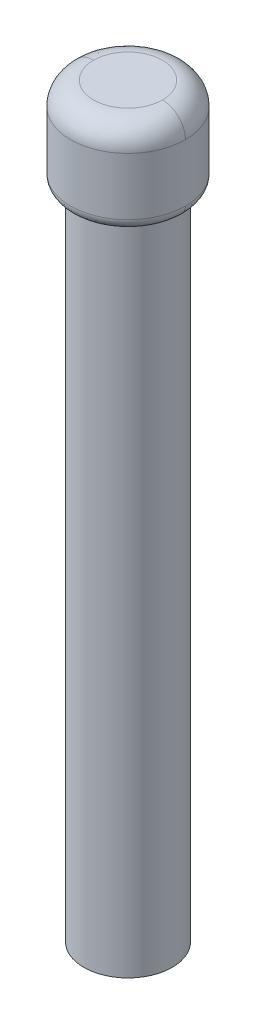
ISO-10303-21;
HEADER;
FILE_DESCRIPTION(('STEP AP214'),'2;1');
FILE_NAME('part.step','',(''),(''),'','','');
FILE_SCHEMA(('AUTOMOTIVE_DESIGN { 1 0 10303 214 1 1 1 1 }'));
ENDSEC;
DATA;
#1=APPLICATION_CONTEXT('core data for automotive mechanical design processes');
#2=APPLICATION_PROTOCOL_DEFINITION('international standard','automotive_design',2000,#1);
#3=PRODUCT_CONTEXT('',#1,'mechanical');
#4=PRODUCT('Part','Part','',(#3));
#5=PRODUCT_RELATED_PRODUCT_CATEGORY('part','',(#4));
#6=PRODUCT_DEFINITION_FORMATION('','',#4);
#7=PRODUCT_DEFINITION_CONTEXT('part definition',#1,'design');
#8=PRODUCT_DEFINITION('design','',#6,#7);
#9=PRODUCT_DEFINITION_SHAPE('','',#8);
#10=(LENGTH_UNIT() NAMED_UNIT(*) SI_UNIT(.MILLI.,.METRE.));
#11=(NAMED_UNIT(*) PLANE_ANGLE_UNIT() SI_UNIT($,.RADIAN.));
#12=(NAMED_UNIT(*) SI_UNIT($,.STERADIAN.) SOLID_ANGLE_UNIT());
#13=UNCERTAINTY_MEASURE_WITH_UNIT(LENGTH_MEASURE(1.E-05),#10,'distance_accuracy_value','');
#14=(GEOMETRIC_REPRESENTATION_CONTEXT(3) GLOBAL_UNCERTAINTY_ASSIGNED_CONTEXT((#13)) GLOBAL_UNIT_ASSIGNED_CONTEXT((#10,
#11,#12)) REPRESENTATION_CONTEXT('',''));
#15=CARTESIAN_POINT('',(0.,0.,0.));
#16=DIRECTION('',(0.,0.,1.));
#17=DIRECTION('',(1.,0.,0.));
#18=AXIS2_PLACEMENT_3D('',#15,#16,#17);
#19=CARTESIAN_POINT('',(0.312,-1.2,57.38699998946));
#20=DIRECTION('',(0.,-1.,0.));
#21=DIRECTION('',(-1.,0.,0.));
#22=AXIS2_PLACEMENT_3D('',#19,#20,#21);
#23=PLANE('',#22);
#24=CARTESIAN_POINT('',(0.,-1.20000000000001,57.075));
#25=DIRECTION('',(0.,-1.,0.));
#26=DIRECTION('',(1.,0.,0.));
#27=AXIS2_PLACEMENT_3D('',#24,#25,#26);
#28=CIRCLE('',#27,0.2999999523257);
#29=CARTESIAN_POINT('',(-0.299999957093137,-1.20000000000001,57.0749999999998));
#30=VERTEX_POINT('',#29);
#31=CARTESIAN_POINT('',(0.299999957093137,-1.20000000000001,57.0750000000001));
#32=VERTEX_POINT('',#31);
#33=EDGE_CURVE('E58',#30,#32,#28,.F.);
#34=ORIENTED_EDGE('',*,*,#33,.T.);
#35=CARTESIAN_POINT('',(0.,-1.20000000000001,57.075));
#36=DIRECTION('',(0.,-1.,0.));
#37=DIRECTION('',(-1.,0.,-8.78926700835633E-13));
#38=AXIS2_PLACEMENT_3D('',#35,#36,#37);
#39=CIRCLE('',#38,0.2999999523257);
#40=EDGE_CURVE('E54',#32,#30,#39,.F.);
#41=ORIENTED_EDGE('',*,*,#40,.T.);
#42=EDGE_LOOP('',(#34,#41));
#43=FACE_BOUND('',#42,.T.);
#44=ADVANCED_FACE('F16',(#43),#23,.F.);
#45=CARTESIAN_POINT('',(0.291258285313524,-1.20018493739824,57.0841226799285));
#46=CARTESIAN_POINT('',(0.416390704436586,-1.19479732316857,57.0880420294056));
#47=CARTESIAN_POINT('',(0.504954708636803,-1.28340450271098,57.0908159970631));
#48=CARTESIAN_POINT('',(0.499570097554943,-1.40859830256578,57.0906473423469));
#49=(BOUNDED_CURVE() B_SPLINE_CURVE(3,(#45,#46,#47,#48),.UNSPECIFIED.,.F.,
.F.) B_SPLINE_CURVE_WITH_KNOTS((4,4),(0.,1.),
.UNSPECIFIED.) CURVE() GEOMETRIC_REPRESENTATION_ITEM() RATIONAL_B_SPLINE_CURVE((1.,
0.784034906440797,0.784034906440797,1.)) REPRESENTATION_ITEM(''));
#50=CARTESIAN_POINT('',(0.,-1.4,57.075));
#51=DIRECTION('',(0.,-1.,0.));
#52=AXIS1_PLACEMENT('',#50,#51);
#53=SURFACE_OF_REVOLUTION('',#49,#52);
#54=CARTESIAN_POINT('',(0.,-1.4,57.075));
#55=DIRECTION('',(0.,-1.,0.));
#56=DIRECTION('',(-1.,0.,0.));
#57=AXIS2_PLACEMENT_3D('',#54,#55,#56);
#58=CIRCLE('',#57,0.5);
#59=CARTESIAN_POINT('',(0.500000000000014,-1.4,57.0750000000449));
#60=VERTEX_POINT('',#59);
#61=CARTESIAN_POINT('',(-0.500000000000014,-1.4,57.075));
#62=VERTEX_POINT('',#61);
#63=EDGE_CURVE('E78',#60,#62,#58,.F.);
#64=ORIENTED_EDGE('',*,*,#63,.T.);
#65=CARTESIAN_POINT('',(-0.300000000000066,-1.4,57.0749999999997));
#66=DIRECTION('',(-1.38581176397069E-12,0.,-1.));
#67=DIRECTION('',(-1.,0.,1.38581176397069E-12));
#68=AXIS2_PLACEMENT_3D('',#65,#66,#67);
#69=CIRCLE('',#68,0.199999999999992);
#70=EDGE_CURVE('E71',#62,#30,#69,.T.);
#71=ORIENTED_EDGE('',*,*,#70,.T.);
#72=ORIENTED_EDGE('',*,*,#40,.F.);
#73=CARTESIAN_POINT('',(0.300000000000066,-1.4,57.075));
#74=DIRECTION('',(-2.2742606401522E-12,0.,-1.));
#75=DIRECTION('',(-1.,0.,2.2742606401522E-12));
#76=AXIS2_PLACEMENT_3D('',#73,#74,#75);
#77=CIRCLE('',#76,0.199999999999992);
#78=EDGE_CURVE('E64',#32,#60,#77,.T.);
#79=ORIENTED_EDGE('',*,*,#78,.T.);
#80=EDGE_LOOP('',(#64,#71,#72,#79));
#81=FACE_BOUND('',#80,.T.);
#82=ADVANCED_FACE('F69',(#81),#53,.T.);
#83=CARTESIAN_POINT('',(-0.291258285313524,-1.20018493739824,57.0658773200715));
#84=CARTESIAN_POINT('',(-0.416390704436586,-1.19479732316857,57.0619579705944));
#85=CARTESIAN_POINT('',(-0.504954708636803,-1.28340450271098,57.0591840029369));
#86=CARTESIAN_POINT('',(-0.499570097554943,-1.40859830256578,57.0593526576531));
#87=(BOUNDED_CURVE() B_SPLINE_CURVE(3,(#83,#84,#85,#86),.UNSPECIFIED.,.F.,
.F.) B_SPLINE_CURVE_WITH_KNOTS((4,4),(0.,1.),
.UNSPECIFIED.) CURVE() GEOMETRIC_REPRESENTATION_ITEM() RATIONAL_B_SPLINE_CURVE((1.,
0.784034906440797,0.784034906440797,1.)) REPRESENTATION_ITEM(''));
#88=CARTESIAN_POINT('',(0.,-1.4,57.075));
#89=DIRECTION('',(0.,-1.,0.));
#90=AXIS1_PLACEMENT('',#88,#89);
#91=SURFACE_OF_REVOLUTION('',#87,#90);
#92=CARTESIAN_POINT('',(0.,-1.4,57.075));
#93=DIRECTION('',(0.,-1.,0.));
#94=DIRECTION('',(-1.,0.,0.));
#95=AXIS2_PLACEMENT_3D('',#92,#93,#94);
#96=CIRCLE('',#95,0.5);
#97=EDGE_CURVE('E75',#62,#60,#96,.F.);
#98=ORIENTED_EDGE('',*,*,#97,.T.);
#99=ORIENTED_EDGE('',*,*,#78,.F.);
#100=ORIENTED_EDGE('',*,*,#33,.F.);
#101=ORIENTED_EDGE('',*,*,#70,.F.);
#102=EDGE_LOOP('',(#98,#99,#100,#101));
#103=FACE_BOUND('',#102,.T.);
#104=ADVANCED_FACE('F73',(#103),#91,.T.);
#105=CARTESIAN_POINT('',(0.,-1.4,57.075));
#106=DIRECTION('',(0.,-1.,0.));
#107=DIRECTION('',(0.,0.,-1.));
#108=AXIS2_PLACEMENT_3D('',#105,#106,#107);
#109=CYLINDRICAL_SURFACE('',#108,0.5);
#110=CARTESIAN_POINT('',(0.,-1.9,57.075));
#111=DIRECTION('',(0.,-1.,0.));
#112=DIRECTION('',(-0.999775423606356,0.,-0.0211920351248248));
#113=AXIS2_PLACEMENT_3D('',#110,#111,#112);
#114=CIRCLE('',#113,0.499999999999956);
#115=CARTESIAN_POINT('',(-0.499999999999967,-1.9,57.0749999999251));
#116=VERTEX_POINT('',#115);
#117=CARTESIAN_POINT('',(0.499999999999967,-1.9,57.0750000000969));
#118=VERTEX_POINT('',#117);
#119=EDGE_CURVE('E152',#116,#118,#114,.F.);
#120=ORIENTED_EDGE('',*,*,#119,.T.);
#121=CARTESIAN_POINT('',(0.,-1.9,57.075));
#122=DIRECTION('',(0.,-1.,0.));
#123=DIRECTION('',(0.999775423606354,0.,0.0211920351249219));
#124=AXIS2_PLACEMENT_3D('',#121,#122,#123);
#125=CIRCLE('',#124,0.499999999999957);
#126=EDGE_CURVE('E179',#118,#116,#125,.F.);
#127=ORIENTED_EDGE('',*,*,#126,.T.);
#128=EDGE_LOOP('',(#120,#127));
#129=FACE_BOUND('',#128,.T.);
#130=ORIENTED_EDGE('',*,*,#63,.F.);
#131=ORIENTED_EDGE('',*,*,#97,.F.);
#132=EDGE_LOOP('',(#130,#131));
#133=FACE_BOUND('',#132,.T.);
#134=ADVANCED_FACE('F172',(#129,#133),#109,.T.);
#135=CARTESIAN_POINT('',(0.49951814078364,-1.8914096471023,57.0855881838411));
#136=CARTESIAN_POINT('',(0.505264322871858,-1.95806845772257,57.0857099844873));
#137=CARTESIAN_POINT('',(0.457965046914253,-2.00537811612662,57.0847073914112));
#138=CARTESIAN_POINT('',(0.391321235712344,-1.99963030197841,57.0832947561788));
#139=(BOUNDED_CURVE() B_SPLINE_CURVE(3,(#135,#136,#137,#138),.UNSPECIFIED.,.F.,
.F.) B_SPLINE_CURVE_WITH_KNOTS((4,4),(0.,1.),
.UNSPECIFIED.) CURVE() GEOMETRIC_REPRESENTATION_ITEM() RATIONAL_B_SPLINE_CURVE((1.,
0.762498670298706,0.762498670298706,1.)) REPRESENTATION_ITEM(''));
#140=CARTESIAN_POINT('',(0.,-1.9,57.075));
#141=DIRECTION('',(0.,-1.,0.));
#142=AXIS1_PLACEMENT('',#140,#141);
#143=SURFACE_OF_REVOLUTION('',#139,#142);
#144=CARTESIAN_POINT('',(0.,-2.,57.075));
#145=DIRECTION('',(0.,1.,0.));
#146=DIRECTION('',(1.,0.,1.99978929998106E-10));
#147=AXIS2_PLACEMENT_3D('',#144,#145,#146);
#148=CIRCLE('',#147,0.39999998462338);
#149=CARTESIAN_POINT('',(0.399999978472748,-2.,57.0750000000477));
#150=VERTEX_POINT('',#149);
#151=CARTESIAN_POINT('',(-0.399999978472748,-2.,57.0749999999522));
#152=VERTEX_POINT('',#151);
#153=EDGE_CURVE('E33',#150,#152,#148,.T.);
#154=ORIENTED_EDGE('',*,*,#153,.T.);
#155=CARTESIAN_POINT('',(-0.399999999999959,-1.9,57.07499999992));
#156=DIRECTION('',(1.99047812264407E-10,-1.94755762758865E-13,-1.));
#157=DIRECTION('',(-1.,0.,-1.99047812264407E-10));
#158=AXIS2_PLACEMENT_3D('',#155,#156,#157);
#159=CIRCLE('',#158,0.0999999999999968);
#160=EDGE_CURVE('E147',#152,#116,#159,.T.);
#161=ORIENTED_EDGE('',*,*,#160,.T.);
#162=ORIENTED_EDGE('',*,*,#126,.F.);
#163=CARTESIAN_POINT('',(0.399999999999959,-1.9,57.0750000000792));
#164=DIRECTION('',(1.97055178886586E-10,0.,-1.));
#165=DIRECTION('',(-1.,0.,-1.97055178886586E-10));
#166=AXIS2_PLACEMENT_3D('',#163,#164,#165);
#167=CIRCLE('',#166,0.099999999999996);
#168=EDGE_CURVE('E148',#118,#150,#167,.T.);
#169=ORIENTED_EDGE('',*,*,#168,.T.);
#170=EDGE_LOOP('',(#154,#161,#162,#169));
#171=FACE_BOUND('',#170,.T.);
#172=ADVANCED_FACE('F167',(#171),#143,.T.);
#173=CARTESIAN_POINT('',(-0.49951814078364,-1.8914096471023,57.0644118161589));
#174=CARTESIAN_POINT('',(-0.505264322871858,-1.95806845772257,57.0642900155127));
#175=CARTESIAN_POINT('',(-0.457965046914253,-2.00537811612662,57.0652926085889));
#176=CARTESIAN_POINT('',(-0.391321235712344,-1.99963030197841,57.0667052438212));
#177=(BOUNDED_CURVE() B_SPLINE_CURVE(3,(#173,#174,#175,#176),.UNSPECIFIED.,.F.,
.F.) B_SPLINE_CURVE_WITH_KNOTS((4,4),(0.,1.),
.UNSPECIFIED.) CURVE() GEOMETRIC_REPRESENTATION_ITEM() RATIONAL_B_SPLINE_CURVE((1.,
0.762498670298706,0.762498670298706,1.)) REPRESENTATION_ITEM(''));
#178=CARTESIAN_POINT('',(0.,-1.9,57.075));
#179=DIRECTION('',(0.,-1.,0.));
#180=AXIS1_PLACEMENT('',#178,#179);
#181=SURFACE_OF_REVOLUTION('',#177,#180);
#182=CARTESIAN_POINT('',(0.,-2.,57.075));
#183=DIRECTION('',(0.,1.,0.));
#184=DIRECTION('',(-1.,0.,-1.99926888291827E-10));
#185=AXIS2_PLACEMENT_3D('',#182,#183,#184);
#186=CIRCLE('',#185,0.39999998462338);
#187=EDGE_CURVE('E135',#152,#150,#186,.T.);
#188=ORIENTED_EDGE('',*,*,#187,.T.);
#189=ORIENTED_EDGE('',*,*,#168,.F.);
#190=ORIENTED_EDGE('',*,*,#119,.F.);
#191=ORIENTED_EDGE('',*,*,#160,.F.);
#192=EDGE_LOOP('',(#188,#189,#190,#191));
#193=FACE_BOUND('',#192,.T.);
#194=ADVANCED_FACE('F171',(#193),#181,.T.);
#195=CARTESIAN_POINT('',(0.416,-2.,57.49099999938));
#196=DIRECTION('',(0.,-1.,0.));
#197=DIRECTION('',(-1.,0.,0.));
#198=AXIS2_PLACEMENT_3D('',#195,#196,#197);
#199=PLANE('',#198);
#200=CARTESIAN_POINT('',(0.,-2.,57.075));
#201=DIRECTION('',(0.,-1.,0.));
#202=DIRECTION('',(0.,0.,-1.));
#203=AXIS2_PLACEMENT_3D('',#200,#201,#202);
#204=CIRCLE('',#203,0.385);
#205=CARTESIAN_POINT('',(0.,-2.,56.69));
#206=VERTEX_POINT('',#205);
#207=EDGE_CURVE('E20',#206,#206,#204,.F.);
#208=ORIENTED_EDGE('',*,*,#207,.T.);
#209=EDGE_LOOP('',(#208));
#210=FACE_BOUND('',#209,.T.);
#211=ORIENTED_EDGE('',*,*,#153,.F.);
#212=ORIENTED_EDGE('',*,*,#187,.F.);
#213=EDGE_LOOP('',(#211,#212));
#214=FACE_BOUND('',#213,.T.);
#215=ADVANCED_FACE('F108',(#210,#214),#199,.T.);
#216=CARTESIAN_POINT('',(0.,-2.,57.075));
#217=DIRECTION('',(0.,-1.,0.));
#218=DIRECTION('',(0.,0.,-1.));
#219=AXIS2_PLACEMENT_3D('',#216,#217,#218);
#220=CYLINDRICAL_SURFACE('',#219,0.385);
#221=ORIENTED_EDGE('',*,*,#207,.F.);
#222=EDGE_LOOP('',(#221));
#223=FACE_BOUND('',#222,.T.);
#224=CARTESIAN_POINT('',(0.,-7.7,57.075));
#225=DIRECTION('',(0.,-1.,0.));
#226=DIRECTION('',(0.,0.,-1.));
#227=AXIS2_PLACEMENT_3D('',#224,#225,#226);
#228=CIRCLE('',#227,0.385);
#229=CARTESIAN_POINT('',(0.,-7.7,56.69));
#230=VERTEX_POINT('',#229);
#231=EDGE_CURVE('E11',#230,#230,#228,.F.);
#232=ORIENTED_EDGE('',*,*,#231,.T.);
#233=EDGE_LOOP('',(#232));
#234=FACE_BOUND('',#233,.T.);
#235=ADVANCED_FACE('F210',(#223,#234),#220,.T.);
#236=CARTESIAN_POINT('',(0.4004,-7.7,57.4754));
#237=DIRECTION('',(0.,-1.,0.));
#238=DIRECTION('',(-1.,0.,0.));
#239=AXIS2_PLACEMENT_3D('',#236,#237,#238);
#240=PLANE('',#239);
#241=ORIENTED_EDGE('',*,*,#231,.F.);
#242=EDGE_LOOP('',(#241));
#243=FACE_BOUND('',#242,.T.);
#244=ADVANCED_FACE('F18',(#243),#240,.T.);
#245=CLOSED_SHELL('',(#44,#82,#104,#134,#172,#194,#215,#235,#244));
#246=MANIFOLD_SOLID_BREP('B1',#245);
#247=ADVANCED_BREP_SHAPE_REPRESENTATION('',(#18,#246),#14);
#248=SHAPE_DEFINITION_REPRESENTATION(#9,#247);
ENDSEC;
END-ISO-10303-21;
